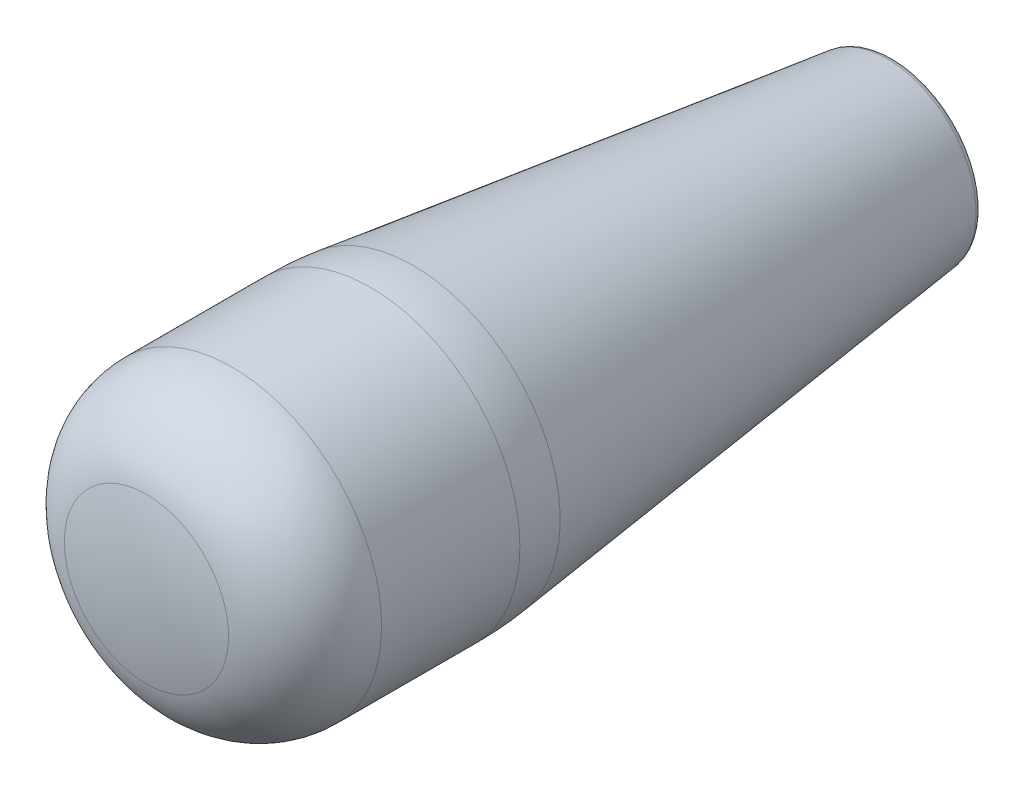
ISO-10303-21;
HEADER;
FILE_DESCRIPTION(('STEP AP214'),'2;1');
FILE_NAME('part.step','',(''),(''),'','','');
FILE_SCHEMA(('AUTOMOTIVE_DESIGN { 1 0 10303 214 1 1 1 1 }'));
ENDSEC;
DATA;
#1=APPLICATION_CONTEXT('core data for automotive mechanical design processes');
#2=APPLICATION_PROTOCOL_DEFINITION('international standard','automotive_design',2000,#1);
#3=PRODUCT_CONTEXT('',#1,'mechanical');
#4=PRODUCT('Part','Part','',(#3));
#5=PRODUCT_RELATED_PRODUCT_CATEGORY('part','',(#4));
#6=PRODUCT_DEFINITION_FORMATION('','',#4);
#7=PRODUCT_DEFINITION_CONTEXT('part definition',#1,'design');
#8=PRODUCT_DEFINITION('design','',#6,#7);
#9=PRODUCT_DEFINITION_SHAPE('','',#8);
#10=(LENGTH_UNIT() NAMED_UNIT(*) SI_UNIT(.MILLI.,.METRE.));
#11=(NAMED_UNIT(*) PLANE_ANGLE_UNIT() SI_UNIT($,.RADIAN.));
#12=(NAMED_UNIT(*) SI_UNIT($,.STERADIAN.) SOLID_ANGLE_UNIT());
#13=UNCERTAINTY_MEASURE_WITH_UNIT(LENGTH_MEASURE(1.E-05),#10,'distance_accuracy_value','');
#14=(GEOMETRIC_REPRESENTATION_CONTEXT(3) GLOBAL_UNCERTAINTY_ASSIGNED_CONTEXT((#13)) GLOBAL_UNIT_ASSIGNED_CONTEXT((#10,
#11,#12)) REPRESENTATION_CONTEXT('',''));
#15=CARTESIAN_POINT('',(0.,0.,0.));
#16=DIRECTION('',(0.,0.,1.));
#17=DIRECTION('',(1.,0.,0.));
#18=AXIS2_PLACEMENT_3D('',#15,#16,#17);
#19=CARTESIAN_POINT('',(0.,0.,7.));
#20=DIRECTION('',(0.,0.,1.));
#21=DIRECTION('',(1.,0.,0.));
#22=AXIS2_PLACEMENT_3D('',#19,#20,#21);
#23=PLANE('',#22);
#24=CARTESIAN_POINT('',(0.,0.,7.));
#25=DIRECTION('',(0.,0.,1.));
#26=DIRECTION('',(1.,0.,0.));
#27=AXIS2_PLACEMENT_3D('',#24,#25,#26);
#28=CIRCLE('',#27,5.25);
#29=CARTESIAN_POINT('',(5.25,0.,7.));
#30=VERTEX_POINT('',#29);
#31=EDGE_CURVE('E38',#30,#30,#28,.T.);
#32=ORIENTED_EDGE('',*,*,#31,.F.);
#33=EDGE_LOOP('',(#32));
#34=FACE_BOUND('',#33,.T.);
#35=CARTESIAN_POINT('',(0.,0.,7.));
#36=DIRECTION('',(0.,0.,1.));
#37=DIRECTION('',(1.,0.,0.));
#38=AXIS2_PLACEMENT_3D('',#35,#36,#37);
#39=CIRCLE('',#38,5.);
#40=CARTESIAN_POINT('',(5.,0.,7.));
#41=VERTEX_POINT('',#40);
#42=EDGE_CURVE('E47',#41,#41,#39,.T.);
#43=ORIENTED_EDGE('',*,*,#42,.T.);
#44=EDGE_LOOP('',(#43));
#45=FACE_BOUND('',#44,.T.);
#46=ADVANCED_FACE('F12',(#34,#45),#23,.F.);
#47=CARTESIAN_POINT('',(0.,0.,0.));
#48=DIRECTION('',(0.,0.,-1.));
#49=DIRECTION('',(-1.,0.,0.));
#50=AXIS2_PLACEMENT_3D('',#47,#48,#49);
#51=PLANE('',#50);
#52=CARTESIAN_POINT('',(0.,0.,0.));
#53=DIRECTION('',(0.,0.,-1.));
#54=DIRECTION('',(-1.,0.,0.));
#55=AXIS2_PLACEMENT_3D('',#52,#53,#54);
#56=CIRCLE('',#55,9.29221978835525);
#57=CARTESIAN_POINT('',(-9.29221978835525,0.,0.));
#58=VERTEX_POINT('',#57);
#59=EDGE_CURVE('E27',#58,#58,#56,.T.);
#60=ORIENTED_EDGE('',*,*,#59,.T.);
#61=EDGE_LOOP('',(#60));
#62=FACE_BOUND('',#61,.T.);
#63=CARTESIAN_POINT('',(0.,0.,0.));
#64=DIRECTION('',(0.,0.,1.));
#65=DIRECTION('',(1.,0.,0.));
#66=AXIS2_PLACEMENT_3D('',#63,#64,#65);
#67=CIRCLE('',#66,5.25);
#68=CARTESIAN_POINT('',(5.25,0.,0.));
#69=VERTEX_POINT('',#68);
#70=EDGE_CURVE('E41',#69,#69,#67,.T.);
#71=ORIENTED_EDGE('',*,*,#70,.T.);
#72=EDGE_LOOP('',(#71));
#73=FACE_BOUND('',#72,.T.);
#74=ADVANCED_FACE('F72',(#62,#73),#51,.T.);
#75=CARTESIAN_POINT('',(0.,0.,75.1719042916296));
#76=DIRECTION('',(0.,0.,-1.));
#77=DIRECTION('',(-1.,0.,0.));
#78=AXIS2_PLACEMENT_3D('',#75,#76,#77);
#79=DEGENERATE_TOROIDAL_SURFACE('',#78,7.,10.,.T.);
#80=CARTESIAN_POINT('',(0.,0.,84.8958723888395));
#81=DIRECTION('',(0.,0.,-1.));
#82=DIRECTION('',(-1.,0.,0.));
#83=AXIS2_PLACEMENT_3D('',#80,#81,#82);
#84=CIRCLE('',#83,9.33333333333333);
#85=CARTESIAN_POINT('',(-9.33333333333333,0.,84.8958723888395));
#86=VERTEX_POINT('',#85);
#87=EDGE_CURVE('E32',#86,#86,#84,.T.);
#88=ORIENTED_EDGE('',*,*,#87,.T.);
#89=EDGE_LOOP('',(#88));
#90=FACE_BOUND('',#89,.T.);
#91=CARTESIAN_POINT('',(0.,0.,75.1719042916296));
#92=DIRECTION('',(0.,0.,-1.));
#93=DIRECTION('',(-1.,0.,0.));
#94=AXIS2_PLACEMENT_3D('',#91,#92,#93);
#95=CIRCLE('',#94,17.);
#96=CARTESIAN_POINT('',(-17.,0.,75.1719042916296));
#97=VERTEX_POINT('',#96);
#98=EDGE_CURVE('E35',#97,#97,#95,.T.);
#99=ORIENTED_EDGE('',*,*,#98,.F.);
#100=EDGE_LOOP('',(#99));
#101=FACE_BOUND('',#100,.T.);
#102=ADVANCED_FACE('F78',(#90,#101),#79,.T.);
#103=CARTESIAN_POINT('',(0.,0.,46.));
#104=DIRECTION('',(0.,0.,-1.));
#105=DIRECTION('',(0.,1.,0.));
#106=AXIS2_PLACEMENT_3D('',#103,#104,#105);
#107=SPHERICAL_SURFACE('',#106,40.);
#108=ORIENTED_EDGE('',*,*,#87,.F.);
#109=EDGE_LOOP('',(#108));
#110=FACE_BOUND('',#109,.T.);
#111=ADVANCED_FACE('F87',(#110),#107,.T.);
#112=CARTESIAN_POINT('',(0.,0.,0.));
#113=DIRECTION('',(0.,0.,1.));
#114=DIRECTION('',(1.,0.,0.));
#115=AXIS2_PLACEMENT_3D('',#112,#113,#114);
#116=CONICAL_SURFACE('',#115,10.,0.122173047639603);
#117=CARTESIAN_POINT('',(0.,0.,54.5821560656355));
#118=DIRECTION('',(0.,0.,-1.));
#119=DIRECTION('',(-1.,0.,0.));
#120=AXIS2_PLACEMENT_3D('',#117,#118,#119);
#121=CIRCLE('',#120,16.7018460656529);
#122=CARTESIAN_POINT('',(-16.7018460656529,0.,54.5821560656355));
#123=VERTEX_POINT('',#122);
#124=EDGE_CURVE('E19',#123,#123,#121,.T.);
#125=ORIENTED_EDGE('',*,*,#124,.T.);
#126=EDGE_LOOP('',(#125));
#127=FACE_BOUND('',#126,.T.);
#128=CARTESIAN_POINT('',(0.,0.,0.702504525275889));
#129=DIRECTION('',(0.,0.,-1.));
#130=DIRECTION('',(-1.,0.,0.));
#131=AXIS2_PLACEMENT_3D('',#128,#129,#130);
#132=CIRCLE('',#131,10.0862567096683);
#133=CARTESIAN_POINT('',(-10.0862567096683,0.,0.702504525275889));
#134=VERTEX_POINT('',#133);
#135=EDGE_CURVE('E23',#134,#134,#132,.F.);
#136=ORIENTED_EDGE('',*,*,#135,.T.);
#137=EDGE_LOOP('',(#136));
#138=FACE_BOUND('',#137,.T.);
#139=ADVANCED_FACE('F85',(#127,#138),#116,.T.);
#140=CARTESIAN_POINT('',(0.,0.,0.));
#141=DIRECTION('',(0.,0.,-1.));
#142=DIRECTION('',(-1.,0.,0.));
#143=AXIS2_PLACEMENT_3D('',#140,#141,#142);
#144=CYLINDRICAL_SURFACE('',#143,17.);
#145=CARTESIAN_POINT('',(0.,0.,59.4569298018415));
#146=DIRECTION('',(0.,0.,1.));
#147=DIRECTION('',(1.,0.,0.));
#148=AXIS2_PLACEMENT_3D('',#145,#146,#147);
#149=CIRCLE('',#148,17.);
#150=CARTESIAN_POINT('',(17.,0.,59.4569298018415));
#151=VERTEX_POINT('',#150);
#152=EDGE_CURVE('E8',#151,#151,#149,.T.);
#153=ORIENTED_EDGE('',*,*,#152,.T.);
#154=EDGE_LOOP('',(#153));
#155=FACE_BOUND('',#154,.T.);
#156=ORIENTED_EDGE('',*,*,#98,.T.);
#157=EDGE_LOOP('',(#156));
#158=FACE_BOUND('',#157,.T.);
#159=ADVANCED_FACE('F67',(#155,#158),#144,.T.);
#160=CARTESIAN_POINT('',(0.,0.,7.));
#161=DIRECTION('',(0.,0.,-1.));
#162=DIRECTION('',(-1.,0.,0.));
#163=AXIS2_PLACEMENT_3D('',#160,#161,#162);
#164=CYLINDRICAL_SURFACE('',#163,5.25);
#165=ORIENTED_EDGE('',*,*,#31,.T.);
#166=EDGE_LOOP('',(#165));
#167=FACE_BOUND('',#166,.T.);
#168=ORIENTED_EDGE('',*,*,#70,.F.);
#169=EDGE_LOOP('',(#168));
#170=FACE_BOUND('',#169,.T.);
#171=ADVANCED_FACE('F55',(#167,#170),#164,.F.);
#172=CARTESIAN_POINT('',(0.,0.,48.));
#173=DIRECTION('',(0.,0.,-1.));
#174=DIRECTION('',(-1.,0.,0.));
#175=AXIS2_PLACEMENT_3D('',#172,#173,#174);
#176=CYLINDRICAL_SURFACE('',#175,5.);
#177=CARTESIAN_POINT('',(0.,0.,48.));
#178=DIRECTION('',(0.,0.,1.));
#179=DIRECTION('',(1.,0.,0.));
#180=AXIS2_PLACEMENT_3D('',#177,#178,#179);
#181=CIRCLE('',#180,5.);
#182=CARTESIAN_POINT('',(5.,0.,48.));
#183=VERTEX_POINT('',#182);
#184=EDGE_CURVE('E44',#183,#183,#181,.T.);
#185=ORIENTED_EDGE('',*,*,#184,.T.);
#186=EDGE_LOOP('',(#185));
#187=FACE_BOUND('',#186,.T.);
#188=ORIENTED_EDGE('',*,*,#42,.F.);
#189=EDGE_LOOP('',(#188));
#190=FACE_BOUND('',#189,.T.);
#191=ADVANCED_FACE('F52',(#187,#190),#176,.F.);
#192=CARTESIAN_POINT('',(0.,0.,48.));
#193=DIRECTION('',(0.,0.,1.));
#194=DIRECTION('',(1.,0.,0.));
#195=AXIS2_PLACEMENT_3D('',#192,#193,#194);
#196=PLANE('',#195);
#197=ORIENTED_EDGE('',*,*,#184,.F.);
#198=EDGE_LOOP('',(#197));
#199=FACE_BOUND('',#198,.T.);
#200=ADVANCED_FACE('F54',(#199),#196,.F.);
#201=CARTESIAN_POINT('',(0.,0.,0.8));
#202=DIRECTION('',(0.,0.,-1.));
#203=DIRECTION('',(-1.,0.,0.));
#204=AXIS2_PLACEMENT_3D('',#201,#202,#203);
#205=TOROIDAL_SURFACE('',#204,9.29221978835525,0.8);
#206=ORIENTED_EDGE('',*,*,#135,.F.);
#207=EDGE_LOOP('',(#206));
#208=FACE_BOUND('',#207,.T.);
#209=ORIENTED_EDGE('',*,*,#59,.F.);
#210=EDGE_LOOP('',(#209));
#211=FACE_BOUND('',#210,.T.);
#212=ADVANCED_FACE('F64',(#208,#211),#205,.T.);
#213=CARTESIAN_POINT('',(0.,0.,59.4569298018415));
#214=DIRECTION('',(0.,0.,1.));
#215=DIRECTION('',(1.,0.,0.));
#216=AXIS2_PLACEMENT_3D('',#213,#214,#215);
#217=DEGENERATE_TOROIDAL_SURFACE('',#216,23.,40.,.F.);
#218=ORIENTED_EDGE('',*,*,#152,.F.);
#219=EDGE_LOOP('',(#218));
#220=FACE_BOUND('',#219,.T.);
#221=ORIENTED_EDGE('',*,*,#124,.F.);
#222=EDGE_LOOP('',(#221));
#223=FACE_BOUND('',#222,.T.);
#224=ADVANCED_FACE('F14',(#220,#223),#217,.F.);
#225=CLOSED_SHELL('',(#46,#74,#102,#111,#139,#159,#171,#191,#200,#212,#224));
#226=MANIFOLD_SOLID_BREP('B1',#225);
#227=ADVANCED_BREP_SHAPE_REPRESENTATION('',(#18,#226),#14);
#228=SHAPE_DEFINITION_REPRESENTATION(#9,#227);
ENDSEC;
END-ISO-10303-21;
